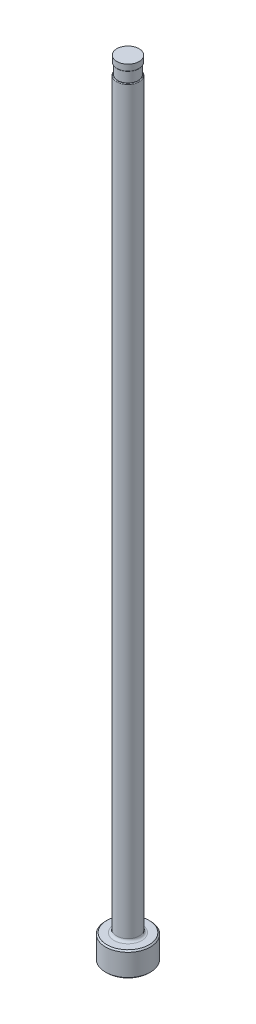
from build123d import *

# Parameters (mm, degrees)
CHAMFER1_SIZE     = 0.254
FILLET1_R         = 0.508
SKETCH2_W         = 0.2032
SKETCH2_H         = 2.032
D_SLOT_DEPTH      = 153.524461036
D_SLOT_DEPTH_BACK = 153.524461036
SKETCH5_W         = 0.01905
SKETCH5_H         = 1.27
FILLET2_R         = 0.127


with BuildPart() as part:
    # Sketch1 → Revolve1 (revolve)
    with BuildSketch(Plane.XY, mode=Mode.PRIVATE) as revolve1_sk:
        Polygon((0, 0), (-4.3561, 0), (-4.3561, 4.7498), (-2.18186, 4.7498), (-2.18186, 152.4), (0, 152.4), align=None)
    revolve(revolve1_sk.sketch.rotate(Axis((0, 259.958771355, 0), (0, -1, 0)), 270), axis=Axis((0, 259.958771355, 0), (0, -1, 0)))

    # Chamfer1
    chamfer1_edges = [part.edges().sort_by_distance(p)[0] for p in [
        (0, 4.7498, -4.3561),
        (0, 0, -4.3561),
    ]]
    chamfer(chamfer1_edges, length=CHAMFER1_SIZE)

    # Fillet1
    fillet1_edges = [part.edges().sort_by_distance(p)[0] for p in [
        (0, 4.7498, -2.18186),
    ]]
    fillet(fillet1_edges, radius=FILLET1_R)

    # Sketch2 → Vent Relief (revolve, cut)
    with BuildSketch(Plane.XY, mode=Mode.PRIVATE) as vent_relief_sk:
        with Locations((-2.08026, 150.114)):
            Rectangle(SKETCH2_W, SKETCH2_H)
    revolve(vent_relief_sk.sketch.rotate(Axis((0, 153.448281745, 0), (0, -1, 0)), 270), axis=Axis((0, 153.448281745, 0), (0, -1, 0)), mode=Mode.SUBTRACT)

    # Sketch3 → D-Slot (cut, two sides: drawn at the far end of the back side and taken through both)
    with BuildSketch(Plane.XY.offset(-D_SLOT_DEPTH_BACK)):
        with BuildLine():
            Line((-1.97866, 150.114), (-1.97866, 86.614))
            ThreePointArc((-1.97866, 86.614), (-2.029873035, 86.046038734), (-2.18186, 85.4964))
            Line((-2.18186, 85.4964), (-2.18186, 150.114))
            Line((-2.18186, 150.114), (-1.97866, 150.114))
        make_face()
    extrude(amount=D_SLOT_DEPTH + D_SLOT_DEPTH_BACK, mode=Mode.SUBTRACT)

    # Sketch5 → Vent Diameter (revolve, cut)
    with BuildSketch(Plane.XY, mode=Mode.PRIVATE) as vent_diameter_sk:
        with Locations((-2.172335, 151.765)):
            Rectangle(SKETCH5_W, SKETCH5_H)
    revolve(vent_diameter_sk.sketch.rotate(Axis((0, 152.687735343, 0), (0, -1, 0)), 90), axis=Axis((0, 152.687735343, 0), (0, -1, 0)), mode=Mode.SUBTRACT)

    # Fillet2
    fillet2_edges = [part.edges().sort_by_distance(p)[0] for p in [
        (1.839382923, 149.098, -1.173534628),
        (0, 151.13, 2.16281),
    ]]
    fillet(fillet2_edges, radius=FILLET2_R)


solid = part.part
